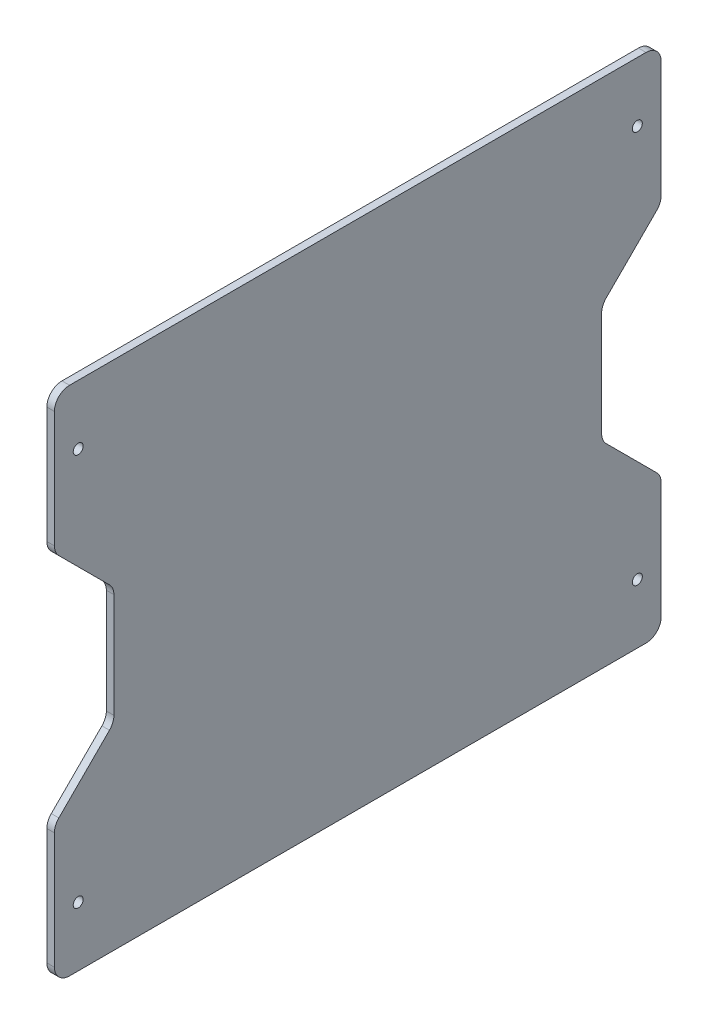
ISO-10303-21;
HEADER;
FILE_DESCRIPTION(('STEP AP214'),'2;1');
FILE_NAME('part.step','',(''),(''),'','','');
FILE_SCHEMA(('AUTOMOTIVE_DESIGN { 1 0 10303 214 1 1 1 1 }'));
ENDSEC;
DATA;
#1=APPLICATION_CONTEXT('core data for automotive mechanical design processes');
#2=APPLICATION_PROTOCOL_DEFINITION('international standard','automotive_design',2000,#1);
#3=PRODUCT_CONTEXT('',#1,'mechanical');
#4=PRODUCT('Part','Part','',(#3));
#5=PRODUCT_RELATED_PRODUCT_CATEGORY('part','',(#4));
#6=PRODUCT_DEFINITION_FORMATION('','',#4);
#7=PRODUCT_DEFINITION_CONTEXT('part definition',#1,'design');
#8=PRODUCT_DEFINITION('design','',#6,#7);
#9=PRODUCT_DEFINITION_SHAPE('','',#8);
#10=(LENGTH_UNIT() NAMED_UNIT(*) SI_UNIT(.MILLI.,.METRE.));
#11=(NAMED_UNIT(*) PLANE_ANGLE_UNIT() SI_UNIT($,.RADIAN.));
#12=(NAMED_UNIT(*) SI_UNIT($,.STERADIAN.) SOLID_ANGLE_UNIT());
#13=UNCERTAINTY_MEASURE_WITH_UNIT(LENGTH_MEASURE(1.E-05),#10,'distance_accuracy_value','');
#14=(GEOMETRIC_REPRESENTATION_CONTEXT(3) GLOBAL_UNCERTAINTY_ASSIGNED_CONTEXT((#13)) GLOBAL_UNIT_ASSIGNED_CONTEXT((#10,
#11,#12)) REPRESENTATION_CONTEXT('',''));
#15=CARTESIAN_POINT('',(0.,0.,0.));
#16=DIRECTION('',(0.,0.,1.));
#17=DIRECTION('',(1.,0.,0.));
#18=AXIS2_PLACEMENT_3D('',#15,#16,#17);
#19=CARTESIAN_POINT('',(-2194.40014568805,-215.000000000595,-470.023442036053));
#20=DIRECTION('',(-1.,0.,0.));
#21=DIRECTION('',(0.,0.,1.));
#22=AXIS2_PLACEMENT_3D('',#19,#20,#21);
#23=PLANE('',#22);
#24=CARTESIAN_POINT('',(-2194.40014568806,-190.000000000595,-10.0000000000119));
#25=DIRECTION('',(1.,0.,0.));
#26=DIRECTION('',(0.,0.,-1.));
#27=AXIS2_PLACEMENT_3D('',#24,#25,#26);
#28=CIRCLE('',#27,2.09500000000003);
#29=CARTESIAN_POINT('',(-2194.40014568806,-190.000000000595,-12.0950000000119));
#30=VERTEX_POINT('',#29);
#31=EDGE_CURVE('E406',#30,#30,#28,.T.);
#32=ORIENTED_EDGE('',*,*,#31,.T.);
#33=EDGE_LOOP('',(#32));
#34=FACE_BOUND('',#33,.T.);
#35=DIRECTION('',(0.,-0.707106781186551,-0.707106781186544));
#36=VECTOR('',#35,1.);
#37=CARTESIAN_POINT('',(-2194.40014568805,-132.100000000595,-230.000000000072));
#38=LINE('',#37,#36);
#39=CARTESIAN_POINT('',(-2194.40014568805,-133.959871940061,-231.859871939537));
#40=VERTEX_POINT('',#39);
#41=CARTESIAN_POINT('',(-2194.40014568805,-155.240128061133,-253.140128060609));
#42=VERTEX_POINT('',#41);
#43=EDGE_CURVE('E272',#40,#42,#38,.T.);
#44=ORIENTED_EDGE('',*,*,#43,.T.);
#45=CARTESIAN_POINT('',(-2194.40014568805,-159.730256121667,-248.650000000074));
#46=DIRECTION('',(-1.,0.,0.));
#47=DIRECTION('',(0.,0.,1.));
#48=AXIS2_PLACEMENT_3D('',#45,#46,#47);
#49=CIRCLE('',#48,6.35);
#50=CARTESIAN_POINT('',(-2194.40014568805,-159.730256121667,-255.000000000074));
#51=VERTEX_POINT('',#50);
#52=EDGE_CURVE('E326',#42,#51,#49,.T.);
#53=ORIENTED_EDGE('',*,*,#52,.T.);
#54=DIRECTION('',(0.,-1.,0.));
#55=VECTOR('',#54,1.);
#56=CARTESIAN_POINT('',(-2194.40014568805,-215.000000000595,-255.000000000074));
#57=LINE('',#56,#55);
#58=CARTESIAN_POINT('',(-2194.40014568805,-208.650000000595,-255.000000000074));
#59=VERTEX_POINT('',#58);
#60=EDGE_CURVE('E259',#51,#59,#57,.T.);
#61=ORIENTED_EDGE('',*,*,#60,.T.);
#62=CARTESIAN_POINT('',(-2194.40014568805,-208.650000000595,-248.650000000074));
#63=DIRECTION('',(-1.,0.,0.));
#64=DIRECTION('',(0.,0.,1.));
#65=AXIS2_PLACEMENT_3D('',#62,#63,#64);
#66=CIRCLE('',#65,6.35);
#67=CARTESIAN_POINT('',(-2194.40014568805,-215.000000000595,-248.650000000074));
#68=VERTEX_POINT('',#67);
#69=EDGE_CURVE('E63',#59,#68,#66,.T.);
#70=ORIENTED_EDGE('',*,*,#69,.T.);
#71=DIRECTION('',(0.,0.,1.));
#72=VECTOR('',#71,1.);
#73=CARTESIAN_POINT('',(-2194.40014568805,-215.000000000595,-470.023442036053));
#74=LINE('',#73,#72);
#75=CARTESIAN_POINT('',(-2194.40014568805,-215.000000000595,-6.35000000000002));
#76=VERTEX_POINT('',#75);
#77=EDGE_CURVE('E258',#68,#76,#74,.T.);
#78=ORIENTED_EDGE('',*,*,#77,.T.);
#79=CARTESIAN_POINT('',(-2194.40014568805,-208.650000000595,-6.35));
#80=DIRECTION('',(-1.,0.,0.));
#81=DIRECTION('',(0.,0.,1.));
#82=AXIS2_PLACEMENT_3D('',#79,#80,#81);
#83=CIRCLE('',#82,6.35);
#84=CARTESIAN_POINT('',(-2194.40014568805,-208.650000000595,0.));
#85=VERTEX_POINT('',#84);
#86=EDGE_CURVE('E313',#76,#85,#83,.T.);
#87=ORIENTED_EDGE('',*,*,#86,.T.);
#88=DIRECTION('',(0.,-1.,0.));
#89=VECTOR('',#88,1.);
#90=CARTESIAN_POINT('',(-2194.40014568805,-215.000000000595,0.));
#91=LINE('',#90,#89);
#92=CARTESIAN_POINT('',(-2194.40014568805,-159.730256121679,0.));
#93=VERTEX_POINT('',#92);
#94=EDGE_CURVE('E246',#93,#85,#91,.T.);
#95=ORIENTED_EDGE('',*,*,#94,.F.);
#96=CARTESIAN_POINT('',(-2194.40014568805,-159.730256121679,-6.35));
#97=DIRECTION('',(-1.,0.,0.));
#98=DIRECTION('',(0.,0.,1.));
#99=AXIS2_PLACEMENT_3D('',#96,#97,#98);
#100=CIRCLE('',#99,6.35);
#101=CARTESIAN_POINT('',(-2194.40014568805,-155.240128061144,-1.85987193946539));
#102=VERTEX_POINT('',#101);
#103=EDGE_CURVE('E322',#93,#102,#100,.T.);
#104=ORIENTED_EDGE('',*,*,#103,.T.);
#105=DIRECTION('',(0.,0.707106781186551,-0.707106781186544));
#106=VECTOR('',#105,1.);
#107=CARTESIAN_POINT('',(-2194.40014568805,-157.500000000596,0.399999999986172));
#108=LINE('',#107,#106);
#109=CARTESIAN_POINT('',(-2194.40014568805,-133.959871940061,-23.1401280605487));
#110=VERTEX_POINT('',#109);
#111=EDGE_CURVE('E283',#102,#110,#108,.T.);
#112=ORIENTED_EDGE('',*,*,#111,.T.);
#113=CARTESIAN_POINT('',(-2194.40014568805,-129.469743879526,-18.650000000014));
#114=DIRECTION('',(-1.,0.,0.));
#115=DIRECTION('',(0.,0.,1.));
#116=AXIS2_PLACEMENT_3D('',#113,#114,#115);
#117=CIRCLE('',#116,6.35);
#118=CARTESIAN_POINT('',(-2194.40014568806,-129.469743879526,-25.000000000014));
#119=VERTEX_POINT('',#118);
#120=EDGE_CURVE('E377',#110,#119,#117,.F.);
#121=ORIENTED_EDGE('',*,*,#120,.T.);
#122=DIRECTION('',(0.,1.,0.));
#123=VECTOR('',#122,1.);
#124=CARTESIAN_POINT('',(-2194.40014568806,0.,-25.000000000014));
#125=LINE('',#124,#123);
#126=CARTESIAN_POINT('',(-2194.40014568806,-85.5302561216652,-25.000000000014));
#127=VERTEX_POINT('',#126);
#128=EDGE_CURVE('E382',#119,#127,#125,.T.);
#129=ORIENTED_EDGE('',*,*,#128,.T.);
#130=CARTESIAN_POINT('',(-2194.40014568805,-85.5302561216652,-18.650000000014));
#131=DIRECTION('',(-1.,0.,0.));
#132=DIRECTION('',(0.,0.,1.));
#133=AXIS2_PLACEMENT_3D('',#130,#131,#132);
#134=CIRCLE('',#133,6.35);
#135=CARTESIAN_POINT('',(-2194.40014568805,-81.0401280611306,-23.1401280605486));
#136=VERTEX_POINT('',#135);
#137=EDGE_CURVE('E49',#127,#136,#134,.F.);
#138=ORIENTED_EDGE('',*,*,#137,.T.);
#139=DIRECTION('',(0.,-0.707106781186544,-0.707106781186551));
#140=VECTOR('',#139,1.);
#141=CARTESIAN_POINT('',(-2194.40014568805,-82.900000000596,-25.000000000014));
#142=LINE('',#141,#140);
#143=CARTESIAN_POINT('',(-2194.40014568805,-59.7598719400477,-1.85987193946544));
#144=VERTEX_POINT('',#143);
#145=EDGE_CURVE('E277',#136,#144,#142,.F.);
#146=ORIENTED_EDGE('',*,*,#145,.T.);
#147=CARTESIAN_POINT('',(-2194.40014568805,-55.2697438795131,-6.35));
#148=DIRECTION('',(-1.,0.,0.));
#149=DIRECTION('',(0.,0.,1.));
#150=AXIS2_PLACEMENT_3D('',#147,#148,#149);
#151=CIRCLE('',#150,6.35);
#152=CARTESIAN_POINT('',(-2194.40014568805,-55.2697438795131,0.));
#153=VERTEX_POINT('',#152);
#154=EDGE_CURVE('E320',#144,#153,#151,.T.);
#155=ORIENTED_EDGE('',*,*,#154,.T.);
#156=CARTESIAN_POINT('',(-2194.40014568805,-6.35000000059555,0.));
#157=VERTEX_POINT('',#156);
#158=EDGE_CURVE('E242',#157,#153,#91,.T.);
#159=ORIENTED_EDGE('',*,*,#158,.F.);
#160=CARTESIAN_POINT('',(-2194.40014568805,-6.35000000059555,-6.35));
#161=DIRECTION('',(-1.,0.,0.));
#162=DIRECTION('',(0.,0.,1.));
#163=AXIS2_PLACEMENT_3D('',#160,#161,#162);
#164=CIRCLE('',#163,6.35);
#165=CARTESIAN_POINT('',(-2194.40014568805,-5.9555138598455E-10,-6.35000000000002));
#166=VERTEX_POINT('',#165);
#167=EDGE_CURVE('E318',#157,#166,#164,.T.);
#168=ORIENTED_EDGE('',*,*,#167,.T.);
#169=DIRECTION('',(0.,0.,1.));
#170=VECTOR('',#169,1.);
#171=CARTESIAN_POINT('',(-2194.40014568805,-5.9555138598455E-10,-470.023442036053));
#172=LINE('',#171,#170);
#173=CARTESIAN_POINT('',(-2194.40014568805,-5.9555138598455E-10,-248.650000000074));
#174=VERTEX_POINT('',#173);
#175=EDGE_CURVE('E245',#174,#166,#172,.T.);
#176=ORIENTED_EDGE('',*,*,#175,.F.);
#177=CARTESIAN_POINT('',(-2194.40014568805,-6.35000000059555,-248.650000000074));
#178=DIRECTION('',(-1.,0.,0.));
#179=DIRECTION('',(0.,0.,1.));
#180=AXIS2_PLACEMENT_3D('',#177,#178,#179);
#181=CIRCLE('',#180,6.35);
#182=CARTESIAN_POINT('',(-2194.40014568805,-6.35000000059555,-255.000000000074));
#183=VERTEX_POINT('',#182);
#184=EDGE_CURVE('E316',#174,#183,#181,.T.);
#185=ORIENTED_EDGE('',*,*,#184,.T.);
#186=CARTESIAN_POINT('',(-2194.40014568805,-55.2697438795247,-255.000000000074));
#187=VERTEX_POINT('',#186);
#188=EDGE_CURVE('E255',#183,#187,#57,.T.);
#189=ORIENTED_EDGE('',*,*,#188,.T.);
#190=CARTESIAN_POINT('',(-2194.40014568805,-55.2697438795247,-248.650000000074));
#191=DIRECTION('',(-1.,0.,0.));
#192=DIRECTION('',(0.,0.,1.));
#193=AXIS2_PLACEMENT_3D('',#190,#191,#192);
#194=CIRCLE('',#193,6.35);
#195=CARTESIAN_POINT('',(-2194.40014568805,-59.7598719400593,-253.140128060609));
#196=VERTEX_POINT('',#195);
#197=EDGE_CURVE('E324',#187,#196,#194,.T.);
#198=ORIENTED_EDGE('',*,*,#197,.T.);
#199=DIRECTION('',(0.,0.707106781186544,-0.707106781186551));
#200=VECTOR('',#199,1.);
#201=CARTESIAN_POINT('',(-2194.40014568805,-57.5000000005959,-255.400000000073));
#202=LINE('',#201,#200);
#203=CARTESIAN_POINT('',(-2194.40014568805,-81.0401280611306,-231.859871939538));
#204=VERTEX_POINT('',#203);
#205=EDGE_CURVE('E267',#196,#204,#202,.F.);
#206=ORIENTED_EDGE('',*,*,#205,.T.);
#207=CARTESIAN_POINT('',(-2194.40014568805,-85.5302561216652,-236.350000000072));
#208=DIRECTION('',(-1.,0.,0.));
#209=DIRECTION('',(0.,0.,1.));
#210=AXIS2_PLACEMENT_3D('',#207,#208,#209);
#211=CIRCLE('',#210,6.35);
#212=CARTESIAN_POINT('',(-2194.40014568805,-85.5302561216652,-230.000000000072));
#213=VERTEX_POINT('',#212);
#214=EDGE_CURVE('E230',#204,#213,#211,.F.);
#215=ORIENTED_EDGE('',*,*,#214,.T.);
#216=DIRECTION('',(0.,1.,0.));
#217=VECTOR('',#216,1.);
#218=CARTESIAN_POINT('',(-2194.40014568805,0.,-230.000000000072));
#219=LINE('',#218,#217);
#220=CARTESIAN_POINT('',(-2194.40014568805,-129.469743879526,-230.000000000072));
#221=VERTEX_POINT('',#220);
#222=EDGE_CURVE('E220',#221,#213,#219,.T.);
#223=ORIENTED_EDGE('',*,*,#222,.F.);
#224=CARTESIAN_POINT('',(-2194.40014568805,-129.469743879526,-236.350000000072));
#225=DIRECTION('',(-1.,0.,0.));
#226=DIRECTION('',(0.,0.,1.));
#227=AXIS2_PLACEMENT_3D('',#224,#225,#226);
#228=CIRCLE('',#227,6.35);
#229=EDGE_CURVE('E203',#221,#40,#228,.F.);
#230=ORIENTED_EDGE('',*,*,#229,.T.);
#231=EDGE_LOOP('',(#44,#53,#61,#70,#78,#87,#95,#104,#112,#121,#129,#138,#146,#155,#159,#168,
#176,#185,#189,#198,#206,#215,#223,#230));
#232=FACE_BOUND('',#231,.T.);
#233=CARTESIAN_POINT('',(-2194.40014568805,-25.0000000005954,-245.000000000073));
#234=DIRECTION('',(-1.,0.,0.));
#235=DIRECTION('',(0.,0.,1.));
#236=AXIS2_PLACEMENT_3D('',#233,#234,#235);
#237=CIRCLE('',#236,2.095);
#238=CARTESIAN_POINT('',(-2194.40014568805,-25.0000000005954,-242.905000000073));
#239=VERTEX_POINT('',#238);
#240=EDGE_CURVE('E239',#239,#239,#237,.T.);
#241=ORIENTED_EDGE('',*,*,#240,.F.);
#242=EDGE_LOOP('',(#241));
#243=FACE_BOUND('',#242,.T.);
#244=CARTESIAN_POINT('',(-2194.40014568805,-190.000000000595,-245.000000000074));
#245=DIRECTION('',(-1.,0.,0.));
#246=DIRECTION('',(0.,0.,1.));
#247=AXIS2_PLACEMENT_3D('',#244,#245,#246);
#248=CIRCLE('',#247,2.09500000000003);
#249=CARTESIAN_POINT('',(-2194.40014568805,-190.000000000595,-242.905000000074));
#250=VERTEX_POINT('',#249);
#251=EDGE_CURVE('E236',#250,#250,#248,.T.);
#252=ORIENTED_EDGE('',*,*,#251,.F.);
#253=EDGE_LOOP('',(#252));
#254=FACE_BOUND('',#253,.T.);
#255=CARTESIAN_POINT('',(-2194.40014568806,-25.0000000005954,-10.0000000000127));
#256=DIRECTION('',(1.,0.,0.));
#257=DIRECTION('',(0.,0.,-1.));
#258=AXIS2_PLACEMENT_3D('',#255,#256,#257);
#259=CIRCLE('',#258,2.095);
#260=CARTESIAN_POINT('',(-2194.40014568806,-25.0000000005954,-12.0950000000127));
#261=VERTEX_POINT('',#260);
#262=EDGE_CURVE('E428',#261,#261,#259,.T.);
#263=ORIENTED_EDGE('',*,*,#262,.T.);
#264=EDGE_LOOP('',(#263));
#265=FACE_BOUND('',#264,.T.);
#266=ADVANCED_FACE('F41',(#34,#232,#243,#254,#265),#23,.T.);
#267=CARTESIAN_POINT('',(-2191.22514568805,-215.000000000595,-470.023442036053));
#268=DIRECTION('',(1.,0.,0.));
#269=DIRECTION('',(0.,0.,-1.));
#270=AXIS2_PLACEMENT_3D('',#267,#268,#269);
#271=PLANE('',#270);
#272=CARTESIAN_POINT('',(-2191.22514568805,-190.000000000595,-10.0000000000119));
#273=DIRECTION('',(1.,0.,0.));
#274=DIRECTION('',(0.,0.,-1.));
#275=AXIS2_PLACEMENT_3D('',#272,#273,#274);
#276=CIRCLE('',#275,2.09500000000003);
#277=CARTESIAN_POINT('',(-2191.22514568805,-190.000000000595,-12.0950000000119));
#278=VERTEX_POINT('',#277);
#279=EDGE_CURVE('E402',#278,#278,#276,.T.);
#280=ORIENTED_EDGE('',*,*,#279,.F.);
#281=EDGE_LOOP('',(#280));
#282=FACE_BOUND('',#281,.T.);
#283=DIRECTION('',(0.,1.,0.));
#284=VECTOR('',#283,1.);
#285=CARTESIAN_POINT('',(-2191.22514568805,-215.000000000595,-255.000000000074));
#286=LINE('',#285,#284);
#287=CARTESIAN_POINT('',(-2191.22514568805,-208.650000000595,-255.000000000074));
#288=VERTEX_POINT('',#287);
#289=CARTESIAN_POINT('',(-2191.22514568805,-159.730256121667,-255.000000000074));
#290=VERTEX_POINT('',#289);
#291=EDGE_CURVE('E253',#288,#290,#286,.T.);
#292=ORIENTED_EDGE('',*,*,#291,.T.);
#293=CARTESIAN_POINT('',(-2191.22514568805,-159.730256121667,-248.650000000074));
#294=DIRECTION('',(1.,0.,0.));
#295=DIRECTION('',(0.,0.,-1.));
#296=AXIS2_PLACEMENT_3D('',#293,#294,#295);
#297=CIRCLE('',#296,6.35);
#298=CARTESIAN_POINT('',(-2191.22514568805,-155.240128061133,-253.140128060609));
#299=VERTEX_POINT('',#298);
#300=EDGE_CURVE('E311',#290,#299,#297,.T.);
#301=ORIENTED_EDGE('',*,*,#300,.T.);
#302=DIRECTION('',(0.,0.707106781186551,0.707106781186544));
#303=VECTOR('',#302,1.);
#304=CARTESIAN_POINT('',(-2191.22514568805,-132.100000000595,-230.000000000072));
#305=LINE('',#304,#303);
#306=CARTESIAN_POINT('',(-2191.22514568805,-133.959871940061,-231.859871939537));
#307=VERTEX_POINT('',#306);
#308=EDGE_CURVE('E274',#299,#307,#305,.T.);
#309=ORIENTED_EDGE('',*,*,#308,.T.);
#310=CARTESIAN_POINT('',(-2191.22514568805,-129.469743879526,-236.350000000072));
#311=DIRECTION('',(1.,0.,0.));
#312=DIRECTION('',(0.,0.,-1.));
#313=AXIS2_PLACEMENT_3D('',#310,#311,#312);
#314=CIRCLE('',#313,6.35);
#315=CARTESIAN_POINT('',(-2191.22514568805,-129.469743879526,-230.000000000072));
#316=VERTEX_POINT('',#315);
#317=EDGE_CURVE('E212',#307,#316,#314,.F.);
#318=ORIENTED_EDGE('',*,*,#317,.T.);
#319=DIRECTION('',(0.,1.,0.));
#320=VECTOR('',#319,1.);
#321=CARTESIAN_POINT('',(-2191.22514568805,0.,-230.000000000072));
#322=LINE('',#321,#320);
#323=CARTESIAN_POINT('',(-2191.22514568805,-85.5302561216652,-230.000000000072));
#324=VERTEX_POINT('',#323);
#325=EDGE_CURVE('E223',#316,#324,#322,.T.);
#326=ORIENTED_EDGE('',*,*,#325,.T.);
#327=CARTESIAN_POINT('',(-2191.22514568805,-85.5302561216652,-236.350000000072));
#328=DIRECTION('',(1.,0.,0.));
#329=DIRECTION('',(0.,0.,-1.));
#330=AXIS2_PLACEMENT_3D('',#327,#328,#329);
#331=CIRCLE('',#330,6.35);
#332=CARTESIAN_POINT('',(-2191.22514568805,-81.0401280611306,-231.859871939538));
#333=VERTEX_POINT('',#332);
#334=EDGE_CURVE('E372',#324,#333,#331,.F.);
#335=ORIENTED_EDGE('',*,*,#334,.T.);
#336=DIRECTION('',(0.,-0.707106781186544,0.707106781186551));
#337=VECTOR('',#336,1.);
#338=CARTESIAN_POINT('',(-2191.22514568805,-57.5000000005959,-255.400000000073));
#339=LINE('',#338,#337);
#340=CARTESIAN_POINT('',(-2191.22514568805,-59.7598719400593,-253.140128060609));
#341=VERTEX_POINT('',#340);
#342=EDGE_CURVE('E269',#333,#341,#339,.F.);
#343=ORIENTED_EDGE('',*,*,#342,.T.);
#344=CARTESIAN_POINT('',(-2191.22514568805,-55.2697438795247,-248.650000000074));
#345=DIRECTION('',(1.,0.,0.));
#346=DIRECTION('',(0.,0.,-1.));
#347=AXIS2_PLACEMENT_3D('',#344,#345,#346);
#348=CIRCLE('',#347,6.35);
#349=CARTESIAN_POINT('',(-2191.22514568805,-55.2697438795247,-255.000000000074));
#350=VERTEX_POINT('',#349);
#351=EDGE_CURVE('E309',#341,#350,#348,.T.);
#352=ORIENTED_EDGE('',*,*,#351,.T.);
#353=CARTESIAN_POINT('',(-2191.22514568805,-6.35000000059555,-255.000000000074));
#354=VERTEX_POINT('',#353);
#355=EDGE_CURVE('E250',#350,#354,#286,.T.);
#356=ORIENTED_EDGE('',*,*,#355,.T.);
#357=CARTESIAN_POINT('',(-2191.22514568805,-6.35000000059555,-248.650000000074));
#358=DIRECTION('',(1.,0.,0.));
#359=DIRECTION('',(0.,0.,-1.));
#360=AXIS2_PLACEMENT_3D('',#357,#358,#359);
#361=CIRCLE('',#360,6.35);
#362=CARTESIAN_POINT('',(-2191.22514568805,-5.9555138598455E-10,-248.650000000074));
#363=VERTEX_POINT('',#362);
#364=EDGE_CURVE('E301',#354,#363,#361,.T.);
#365=ORIENTED_EDGE('',*,*,#364,.T.);
#366=DIRECTION('',(0.,0.,1.));
#367=VECTOR('',#366,1.);
#368=CARTESIAN_POINT('',(-2191.22514568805,-5.9555138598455E-10,-470.023442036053));
#369=LINE('',#368,#367);
#370=CARTESIAN_POINT('',(-2191.22514568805,-5.9555138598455E-10,-6.35000000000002));
#371=VERTEX_POINT('',#370);
#372=EDGE_CURVE('E264',#363,#371,#369,.T.);
#373=ORIENTED_EDGE('',*,*,#372,.T.);
#374=CARTESIAN_POINT('',(-2191.22514568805,-6.35000000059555,-6.35));
#375=DIRECTION('',(1.,0.,0.));
#376=DIRECTION('',(0.,0.,-1.));
#377=AXIS2_PLACEMENT_3D('',#374,#375,#376);
#378=CIRCLE('',#377,6.35);
#379=CARTESIAN_POINT('',(-2191.22514568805,-6.35000000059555,0.));
#380=VERTEX_POINT('',#379);
#381=EDGE_CURVE('E303',#371,#380,#378,.T.);
#382=ORIENTED_EDGE('',*,*,#381,.T.);
#383=DIRECTION('',(0.,1.,0.));
#384=VECTOR('',#383,1.);
#385=CARTESIAN_POINT('',(-2191.22514568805,-215.000000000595,0.));
#386=LINE('',#385,#384);
#387=CARTESIAN_POINT('',(-2191.22514568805,-55.2697438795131,0.));
#388=VERTEX_POINT('',#387);
#389=EDGE_CURVE('E233',#388,#380,#386,.T.);
#390=ORIENTED_EDGE('',*,*,#389,.F.);
#391=CARTESIAN_POINT('',(-2191.22514568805,-55.2697438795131,-6.35));
#392=DIRECTION('',(1.,0.,0.));
#393=DIRECTION('',(0.,0.,-1.));
#394=AXIS2_PLACEMENT_3D('',#391,#392,#393);
#395=CIRCLE('',#394,6.35);
#396=CARTESIAN_POINT('',(-2191.22514568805,-59.7598719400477,-1.85987193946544));
#397=VERTEX_POINT('',#396);
#398=EDGE_CURVE('E305',#388,#397,#395,.T.);
#399=ORIENTED_EDGE('',*,*,#398,.T.);
#400=DIRECTION('',(0.,0.707106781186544,0.707106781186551));
#401=VECTOR('',#400,1.);
#402=CARTESIAN_POINT('',(-2191.22514568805,-82.9000000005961,-25.000000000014));
#403=LINE('',#402,#401);
#404=CARTESIAN_POINT('',(-2191.22514568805,-81.0401280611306,-23.1401280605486));
#405=VERTEX_POINT('',#404);
#406=EDGE_CURVE('E280',#397,#405,#403,.F.);
#407=ORIENTED_EDGE('',*,*,#406,.T.);
#408=CARTESIAN_POINT('',(-2191.22514568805,-85.5302561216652,-18.650000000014));
#409=DIRECTION('',(1.,0.,0.));
#410=DIRECTION('',(0.,0.,-1.));
#411=AXIS2_PLACEMENT_3D('',#408,#409,#410);
#412=CIRCLE('',#411,6.35);
#413=CARTESIAN_POINT('',(-2191.22514568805,-85.5302561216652,-25.000000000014));
#414=VERTEX_POINT('',#413);
#415=EDGE_CURVE('E11',#405,#414,#412,.F.);
#416=ORIENTED_EDGE('',*,*,#415,.T.);
#417=DIRECTION('',(0.,1.,0.));
#418=VECTOR('',#417,1.);
#419=CARTESIAN_POINT('',(-2191.22514568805,0.,-25.000000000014));
#420=LINE('',#419,#418);
#421=CARTESIAN_POINT('',(-2191.22514568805,-129.469743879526,-25.000000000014));
#422=VERTEX_POINT('',#421);
#423=EDGE_CURVE('E398',#422,#414,#420,.T.);
#424=ORIENTED_EDGE('',*,*,#423,.F.);
#425=CARTESIAN_POINT('',(-2191.22514568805,-129.469743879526,-18.650000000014));
#426=DIRECTION('',(1.,0.,0.));
#427=DIRECTION('',(0.,0.,-1.));
#428=AXIS2_PLACEMENT_3D('',#425,#426,#427);
#429=CIRCLE('',#428,6.35);
#430=CARTESIAN_POINT('',(-2191.22514568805,-133.959871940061,-23.1401280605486));
#431=VERTEX_POINT('',#430);
#432=EDGE_CURVE('E375',#422,#431,#429,.F.);
#433=ORIENTED_EDGE('',*,*,#432,.T.);
#434=DIRECTION('',(0.,-0.707106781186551,0.707106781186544));
#435=VECTOR('',#434,1.);
#436=CARTESIAN_POINT('',(-2191.22514568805,-157.500000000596,0.399999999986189));
#437=LINE('',#436,#435);
#438=CARTESIAN_POINT('',(-2191.22514568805,-155.240128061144,-1.85987193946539));
#439=VERTEX_POINT('',#438);
#440=EDGE_CURVE('E286',#431,#439,#437,.T.);
#441=ORIENTED_EDGE('',*,*,#440,.T.);
#442=CARTESIAN_POINT('',(-2191.22514568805,-159.730256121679,-6.35));
#443=DIRECTION('',(1.,0.,0.));
#444=DIRECTION('',(0.,0.,-1.));
#445=AXIS2_PLACEMENT_3D('',#442,#443,#444);
#446=CIRCLE('',#445,6.35);
#447=CARTESIAN_POINT('',(-2191.22514568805,-159.730256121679,0.));
#448=VERTEX_POINT('',#447);
#449=EDGE_CURVE('E307',#439,#448,#446,.T.);
#450=ORIENTED_EDGE('',*,*,#449,.T.);
#451=CARTESIAN_POINT('',(-2191.22514568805,-208.650000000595,0.));
#452=VERTEX_POINT('',#451);
#453=EDGE_CURVE('E249',#452,#448,#386,.T.);
#454=ORIENTED_EDGE('',*,*,#453,.F.);
#455=CARTESIAN_POINT('',(-2191.22514568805,-208.650000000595,-6.35));
#456=DIRECTION('',(1.,0.,0.));
#457=DIRECTION('',(0.,0.,-1.));
#458=AXIS2_PLACEMENT_3D('',#455,#456,#457);
#459=CIRCLE('',#458,6.35);
#460=CARTESIAN_POINT('',(-2191.22514568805,-215.000000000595,-6.35000000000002));
#461=VERTEX_POINT('',#460);
#462=EDGE_CURVE('E297',#452,#461,#459,.T.);
#463=ORIENTED_EDGE('',*,*,#462,.T.);
#464=DIRECTION('',(0.,0.,1.));
#465=VECTOR('',#464,1.);
#466=CARTESIAN_POINT('',(-2191.22514568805,-215.000000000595,-470.023442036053));
#467=LINE('',#466,#465);
#468=CARTESIAN_POINT('',(-2191.22514568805,-215.000000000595,-248.650000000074));
#469=VERTEX_POINT('',#468);
#470=EDGE_CURVE('E254',#469,#461,#467,.T.);
#471=ORIENTED_EDGE('',*,*,#470,.F.);
#472=CARTESIAN_POINT('',(-2191.22514568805,-208.650000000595,-248.650000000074));
#473=DIRECTION('',(1.,0.,0.));
#474=DIRECTION('',(0.,0.,-1.));
#475=AXIS2_PLACEMENT_3D('',#472,#473,#474);
#476=CIRCLE('',#475,6.35);
#477=EDGE_CURVE('E299',#469,#288,#476,.T.);
#478=ORIENTED_EDGE('',*,*,#477,.T.);
#479=EDGE_LOOP('',(#292,#301,#309,#318,#326,#335,#343,#352,#356,#365,#373,#382,#390,#399,#407,
#416,#424,#433,#441,#450,#454,#463,#471,#478));
#480=FACE_BOUND('',#479,.T.);
#481=CARTESIAN_POINT('',(-2191.22514568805,-25.0000000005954,-245.000000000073));
#482=DIRECTION('',(1.,0.,0.));
#483=DIRECTION('',(0.,0.,-1.));
#484=AXIS2_PLACEMENT_3D('',#481,#482,#483);
#485=CIRCLE('',#484,2.095);
#486=CARTESIAN_POINT('',(-2191.22514568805,-25.0000000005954,-247.095000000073));
#487=VERTEX_POINT('',#486);
#488=EDGE_CURVE('E413',#487,#487,#485,.F.);
#489=ORIENTED_EDGE('',*,*,#488,.T.);
#490=EDGE_LOOP('',(#489));
#491=FACE_BOUND('',#490,.T.);
#492=CARTESIAN_POINT('',(-2191.22514568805,-190.000000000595,-245.000000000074));
#493=DIRECTION('',(1.,0.,0.));
#494=DIRECTION('',(0.,0.,-1.));
#495=AXIS2_PLACEMENT_3D('',#492,#493,#494);
#496=CIRCLE('',#495,2.09500000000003);
#497=CARTESIAN_POINT('',(-2191.22514568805,-190.000000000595,-247.095000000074));
#498=VERTEX_POINT('',#497);
#499=EDGE_CURVE('E231',#498,#498,#496,.F.);
#500=ORIENTED_EDGE('',*,*,#499,.T.);
#501=EDGE_LOOP('',(#500));
#502=FACE_BOUND('',#501,.T.);
#503=CARTESIAN_POINT('',(-2191.22514568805,-25.0000000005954,-10.0000000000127));
#504=DIRECTION('',(1.,0.,0.));
#505=DIRECTION('',(0.,0.,-1.));
#506=AXIS2_PLACEMENT_3D('',#503,#504,#505);
#507=CIRCLE('',#506,2.095);
#508=CARTESIAN_POINT('',(-2191.22514568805,-25.0000000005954,-12.0950000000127));
#509=VERTEX_POINT('',#508);
#510=EDGE_CURVE('E409',#509,#509,#507,.T.);
#511=ORIENTED_EDGE('',*,*,#510,.F.);
#512=EDGE_LOOP('',(#511));
#513=FACE_BOUND('',#512,.T.);
#514=ADVANCED_FACE('F396',(#282,#480,#491,#502,#513),#271,.T.);
#515=CARTESIAN_POINT('',(0.,0.,0.));
#516=DIRECTION('',(0.,0.,1.));
#517=DIRECTION('',(1.,0.,0.));
#518=AXIS2_PLACEMENT_3D('',#515,#516,#517);
#519=PLANE('',#518);
#520=ORIENTED_EDGE('',*,*,#158,.T.);
#521=DIRECTION('',(-1.,0.,0.));
#522=VECTOR('',#521,1.);
#523=CARTESIAN_POINT('',(-2191.22514568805,-55.2697438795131,0.));
#524=LINE('',#523,#522);
#525=EDGE_CURVE('E360',#153,#388,#524,.F.);
#526=ORIENTED_EDGE('',*,*,#525,.T.);
#527=ORIENTED_EDGE('',*,*,#389,.T.);
#528=DIRECTION('',(-1.,0.,0.));
#529=VECTOR('',#528,1.);
#530=CARTESIAN_POINT('',(0.,-6.35000000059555,0.));
#531=LINE('',#530,#529);
#532=EDGE_CURVE('E357',#380,#157,#531,.T.);
#533=ORIENTED_EDGE('',*,*,#532,.T.);
#534=EDGE_LOOP('',(#520,#526,#527,#533));
#535=FACE_BOUND('',#534,.T.);
#536=ADVANCED_FACE('F466',(#535),#519,.T.);
#537=CARTESIAN_POINT('',(-2168.52514568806,-5.95468119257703E-10,-255.000000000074));
#538=DIRECTION('',(0.,0.,-1.));
#539=DIRECTION('',(-1.,0.,0.));
#540=AXIS2_PLACEMENT_3D('',#537,#538,#539);
#541=PLANE('',#540);
#542=ORIENTED_EDGE('',*,*,#60,.F.);
#543=DIRECTION('',(1.,0.,0.));
#544=VECTOR('',#543,1.);
#545=CARTESIAN_POINT('',(-2191.22514568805,-159.730256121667,-255.000000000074));
#546=LINE('',#545,#544);
#547=EDGE_CURVE('E294',#51,#290,#546,.T.);
#548=ORIENTED_EDGE('',*,*,#547,.T.);
#549=ORIENTED_EDGE('',*,*,#291,.F.);
#550=DIRECTION('',(1.,0.,0.));
#551=VECTOR('',#550,1.);
#552=CARTESIAN_POINT('',(-2168.52514568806,-208.650000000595,-255.000000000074));
#553=LINE('',#552,#551);
#554=EDGE_CURVE('E292',#288,#59,#553,.F.);
#555=ORIENTED_EDGE('',*,*,#554,.T.);
#556=EDGE_LOOP('',(#542,#548,#549,#555));
#557=FACE_BOUND('',#556,.T.);
#558=ADVANCED_FACE('F477',(#557),#541,.T.);
#559=ORIENTED_EDGE('',*,*,#355,.F.);
#560=DIRECTION('',(1.,0.,0.));
#561=VECTOR('',#560,1.);
#562=CARTESIAN_POINT('',(-2194.40014568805,-55.2697438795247,-255.000000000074));
#563=LINE('',#562,#561);
#564=EDGE_CURVE('E334',#350,#187,#563,.F.);
#565=ORIENTED_EDGE('',*,*,#564,.T.);
#566=ORIENTED_EDGE('',*,*,#188,.F.);
#567=DIRECTION('',(-1.,0.,0.));
#568=VECTOR('',#567,1.);
#569=CARTESIAN_POINT('',(-2168.52514568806,-6.35000000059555,-255.000000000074));
#570=LINE('',#569,#568);
#571=EDGE_CURVE('E332',#183,#354,#570,.F.);
#572=ORIENTED_EDGE('',*,*,#571,.T.);
#573=EDGE_LOOP('',(#559,#565,#566,#572));
#574=FACE_BOUND('',#573,.T.);
#575=ADVANCED_FACE('F464',(#574),#541,.T.);
#576=ORIENTED_EDGE('',*,*,#453,.T.);
#577=DIRECTION('',(-1.,0.,0.));
#578=VECTOR('',#577,1.);
#579=CARTESIAN_POINT('',(-2194.40014568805,-159.730256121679,0.));
#580=LINE('',#579,#578);
#581=EDGE_CURVE('E340',#448,#93,#580,.T.);
#582=ORIENTED_EDGE('',*,*,#581,.T.);
#583=ORIENTED_EDGE('',*,*,#94,.T.);
#584=DIRECTION('',(1.,0.,0.));
#585=VECTOR('',#584,1.);
#586=CARTESIAN_POINT('',(0.,-208.650000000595,0.));
#587=LINE('',#586,#585);
#588=EDGE_CURVE('E337',#85,#452,#587,.T.);
#589=ORIENTED_EDGE('',*,*,#588,.T.);
#590=EDGE_LOOP('',(#576,#582,#583,#589));
#591=FACE_BOUND('',#590,.T.);
#592=ADVANCED_FACE('F460',(#591),#519,.T.);
#593=CARTESIAN_POINT('',(-2191.22514568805,-5.9555138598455E-10,-470.023442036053));
#594=DIRECTION('',(0.,1.,0.));
#595=DIRECTION('',(0.,0.,1.));
#596=AXIS2_PLACEMENT_3D('',#593,#594,#595);
#597=PLANE('',#596);
#598=ORIENTED_EDGE('',*,*,#175,.T.);
#599=DIRECTION('',(-1.,0.,0.));
#600=VECTOR('',#599,1.);
#601=CARTESIAN_POINT('',(-2191.22514568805,-5.9555138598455E-10,-6.35000000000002));
#602=LINE('',#601,#600);
#603=EDGE_CURVE('E366',#166,#371,#602,.F.);
#604=ORIENTED_EDGE('',*,*,#603,.T.);
#605=ORIENTED_EDGE('',*,*,#372,.F.);
#606=DIRECTION('',(-1.,0.,0.));
#607=VECTOR('',#606,1.);
#608=CARTESIAN_POINT('',(-2191.22514568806,-5.9555138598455E-10,-248.650000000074));
#609=LINE('',#608,#607);
#610=EDGE_CURVE('E363',#363,#174,#609,.T.);
#611=ORIENTED_EDGE('',*,*,#610,.T.);
#612=EDGE_LOOP('',(#598,#604,#605,#611));
#613=FACE_BOUND('',#612,.T.);
#614=ADVANCED_FACE('F463',(#613),#597,.T.);
#615=CARTESIAN_POINT('',(-2191.22514568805,-215.000000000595,-470.023442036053));
#616=DIRECTION('',(0.,-1.,0.));
#617=DIRECTION('',(0.,0.,-1.));
#618=AXIS2_PLACEMENT_3D('',#615,#616,#617);
#619=PLANE('',#618);
#620=ORIENTED_EDGE('',*,*,#77,.F.);
#621=DIRECTION('',(1.,0.,0.));
#622=VECTOR('',#621,1.);
#623=CARTESIAN_POINT('',(-2191.22514568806,-215.000000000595,-248.650000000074));
#624=LINE('',#623,#622);
#625=EDGE_CURVE('E213',#68,#469,#624,.T.);
#626=ORIENTED_EDGE('',*,*,#625,.T.);
#627=ORIENTED_EDGE('',*,*,#470,.T.);
#628=DIRECTION('',(1.,0.,0.));
#629=VECTOR('',#628,1.);
#630=CARTESIAN_POINT('',(-2191.22514568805,-215.000000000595,-6.35000000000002));
#631=LINE('',#630,#629);
#632=EDGE_CURVE('E56',#461,#76,#631,.F.);
#633=ORIENTED_EDGE('',*,*,#632,.T.);
#634=EDGE_LOOP('',(#620,#626,#627,#633));
#635=FACE_BOUND('',#634,.T.);
#636=ADVANCED_FACE('F459',(#635),#619,.T.);
#637=CARTESIAN_POINT('',(-2191.22414568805,0.,-230.000000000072));
#638=DIRECTION('',(0.,0.,1.));
#639=DIRECTION('',(1.,0.,0.));
#640=AXIS2_PLACEMENT_3D('',#637,#638,#639);
#641=PLANE('',#640);
#642=ORIENTED_EDGE('',*,*,#325,.F.);
#643=DIRECTION('',(-1.,0.,0.));
#644=VECTOR('',#643,1.);
#645=CARTESIAN_POINT('',(-2194.40014568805,-129.469743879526,-230.000000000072));
#646=LINE('',#645,#644);
#647=EDGE_CURVE('E207',#316,#221,#646,.T.);
#648=ORIENTED_EDGE('',*,*,#647,.T.);
#649=ORIENTED_EDGE('',*,*,#222,.T.);
#650=DIRECTION('',(-1.,0.,0.));
#651=VECTOR('',#650,1.);
#652=CARTESIAN_POINT('',(-2191.22514568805,-85.5302561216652,-230.000000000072));
#653=LINE('',#652,#651);
#654=EDGE_CURVE('E225',#213,#324,#653,.F.);
#655=ORIENTED_EDGE('',*,*,#654,.T.);
#656=EDGE_LOOP('',(#642,#648,#649,#655));
#657=FACE_BOUND('',#656,.T.);
#658=ADVANCED_FACE('F218',(#657),#641,.F.);
#659=CARTESIAN_POINT('',(-2191.22414568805,-190.000000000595,-245.000000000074));
#660=DIRECTION('',(-1.,0.,0.));
#661=DIRECTION('',(0.,0.,1.));
#662=AXIS2_PLACEMENT_3D('',#659,#660,#661);
#663=CYLINDRICAL_SURFACE('',#662,2.09500000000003);
#664=ORIENTED_EDGE('',*,*,#499,.F.);
#665=EDGE_LOOP('',(#664));
#666=FACE_BOUND('',#665,.T.);
#667=ORIENTED_EDGE('',*,*,#251,.T.);
#668=EDGE_LOOP('',(#667));
#669=FACE_BOUND('',#668,.T.);
#670=ADVANCED_FACE('F450',(#666,#669),#663,.F.);
#671=CARTESIAN_POINT('',(-2191.22414568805,-25.0000000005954,-245.000000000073));
#672=DIRECTION('',(-1.,0.,0.));
#673=DIRECTION('',(0.,0.,1.));
#674=AXIS2_PLACEMENT_3D('',#671,#672,#673);
#675=CYLINDRICAL_SURFACE('',#674,2.095);
#676=ORIENTED_EDGE('',*,*,#488,.F.);
#677=EDGE_LOOP('',(#676));
#678=FACE_BOUND('',#677,.T.);
#679=ORIENTED_EDGE('',*,*,#240,.T.);
#680=EDGE_LOOP('',(#679));
#681=FACE_BOUND('',#680,.T.);
#682=ADVANCED_FACE('F419',(#678,#681),#675,.F.);
#683=CARTESIAN_POINT('',(-2191.22414568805,-57.5000000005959,-255.400000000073));
#684=DIRECTION('',(0.,-0.707106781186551,-0.707106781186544));
#685=DIRECTION('',(1.,0.,0.));
#686=AXIS2_PLACEMENT_3D('',#683,#684,#685);
#687=PLANE('',#686);
#688=ORIENTED_EDGE('',*,*,#342,.F.);
#689=DIRECTION('',(1.,0.,0.));
#690=VECTOR('',#689,1.);
#691=CARTESIAN_POINT('',(-2194.40014568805,-81.0401280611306,-231.859871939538));
#692=LINE('',#691,#690);
#693=EDGE_CURVE('E330',#333,#204,#692,.F.);
#694=ORIENTED_EDGE('',*,*,#693,.T.);
#695=ORIENTED_EDGE('',*,*,#205,.F.);
#696=DIRECTION('',(-1.,0.,0.));
#697=VECTOR('',#696,1.);
#698=CARTESIAN_POINT('',(-2191.22514568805,-59.7598719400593,-253.140128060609));
#699=LINE('',#698,#697);
#700=EDGE_CURVE('E328',#196,#341,#699,.F.);
#701=ORIENTED_EDGE('',*,*,#700,.T.);
#702=EDGE_LOOP('',(#688,#694,#695,#701));
#703=FACE_BOUND('',#702,.T.);
#704=ADVANCED_FACE('F455',(#703),#687,.T.);
#705=CARTESIAN_POINT('',(-2191.22414568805,-132.100000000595,-230.000000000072));
#706=DIRECTION('',(0.,-0.707106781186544,0.707106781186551));
#707=DIRECTION('',(-1.,0.,0.));
#708=AXIS2_PLACEMENT_3D('',#705,#706,#707);
#709=PLANE('',#708);
#710=ORIENTED_EDGE('',*,*,#43,.F.);
#711=DIRECTION('',(-1.,0.,0.));
#712=VECTOR('',#711,1.);
#713=CARTESIAN_POINT('',(-2191.22514568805,-133.959871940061,-231.859871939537));
#714=LINE('',#713,#712);
#715=EDGE_CURVE('E208',#40,#307,#714,.F.);
#716=ORIENTED_EDGE('',*,*,#715,.T.);
#717=ORIENTED_EDGE('',*,*,#308,.F.);
#718=DIRECTION('',(1.,0.,0.));
#719=VECTOR('',#718,1.);
#720=CARTESIAN_POINT('',(-2194.40014568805,-155.240128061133,-253.140128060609));
#721=LINE('',#720,#719);
#722=EDGE_CURVE('E224',#299,#42,#721,.F.);
#723=ORIENTED_EDGE('',*,*,#722,.T.);
#724=EDGE_LOOP('',(#710,#716,#717,#723));
#725=FACE_BOUND('',#724,.T.);
#726=ADVANCED_FACE('F447',(#725),#709,.F.);
#727=CARTESIAN_POINT('',(-2191.22414568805,0.,-25.000000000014));
#728=DIRECTION('',(0.,0.,1.));
#729=DIRECTION('',(1.,0.,0.));
#730=AXIS2_PLACEMENT_3D('',#727,#728,#729);
#731=PLANE('',#730);
#732=ORIENTED_EDGE('',*,*,#128,.F.);
#733=DIRECTION('',(1.,0.,0.));
#734=VECTOR('',#733,1.);
#735=CARTESIAN_POINT('',(-2191.22414568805,-129.469743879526,-25.000000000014));
#736=LINE('',#735,#734);
#737=EDGE_CURVE('E350',#119,#422,#736,.T.);
#738=ORIENTED_EDGE('',*,*,#737,.T.);
#739=ORIENTED_EDGE('',*,*,#423,.T.);
#740=DIRECTION('',(1.,0.,0.));
#741=VECTOR('',#740,1.);
#742=CARTESIAN_POINT('',(-2191.22414568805,-85.5302561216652,-25.000000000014));
#743=LINE('',#742,#741);
#744=EDGE_CURVE('E347',#414,#127,#743,.F.);
#745=ORIENTED_EDGE('',*,*,#744,.T.);
#746=EDGE_LOOP('',(#732,#738,#739,#745));
#747=FACE_BOUND('',#746,.T.);
#748=ADVANCED_FACE('F400',(#747),#731,.T.);
#749=CARTESIAN_POINT('',(-2191.22414568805,-190.000000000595,-10.0000000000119));
#750=DIRECTION('',(-1.,0.,0.));
#751=DIRECTION('',(0.,0.,1.));
#752=AXIS2_PLACEMENT_3D('',#749,#750,#751);
#753=CYLINDRICAL_SURFACE('',#752,2.09500000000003);
#754=ORIENTED_EDGE('',*,*,#279,.T.);
#755=EDGE_LOOP('',(#754));
#756=FACE_BOUND('',#755,.T.);
#757=ORIENTED_EDGE('',*,*,#31,.F.);
#758=EDGE_LOOP('',(#757));
#759=FACE_BOUND('',#758,.T.);
#760=ADVANCED_FACE('F435',(#756,#759),#753,.F.);
#761=CARTESIAN_POINT('',(-2191.22414568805,-25.0000000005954,-10.0000000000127));
#762=DIRECTION('',(-1.,0.,0.));
#763=DIRECTION('',(0.,0.,1.));
#764=AXIS2_PLACEMENT_3D('',#761,#762,#763);
#765=CYLINDRICAL_SURFACE('',#764,2.095);
#766=ORIENTED_EDGE('',*,*,#510,.T.);
#767=EDGE_LOOP('',(#766));
#768=FACE_BOUND('',#767,.T.);
#769=ORIENTED_EDGE('',*,*,#262,.F.);
#770=EDGE_LOOP('',(#769));
#771=FACE_BOUND('',#770,.T.);
#772=ADVANCED_FACE('F437',(#768,#771),#765,.F.);
#773=CARTESIAN_POINT('',(-2191.22414568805,-82.9000000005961,-25.000000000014));
#774=DIRECTION('',(0.,-0.707106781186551,0.707106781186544));
#775=DIRECTION('',(1.,0.,0.));
#776=AXIS2_PLACEMENT_3D('',#773,#774,#775);
#777=PLANE('',#776);
#778=ORIENTED_EDGE('',*,*,#145,.F.);
#779=DIRECTION('',(-1.,0.,0.));
#780=VECTOR('',#779,1.);
#781=CARTESIAN_POINT('',(-2191.22414568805,-81.0401280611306,-23.1401280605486));
#782=LINE('',#781,#780);
#783=EDGE_CURVE('E355',#136,#405,#782,.F.);
#784=ORIENTED_EDGE('',*,*,#783,.T.);
#785=ORIENTED_EDGE('',*,*,#406,.F.);
#786=DIRECTION('',(1.,0.,0.));
#787=VECTOR('',#786,1.);
#788=CARTESIAN_POINT('',(-2194.40014568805,-59.7598719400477,-1.85987193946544));
#789=LINE('',#788,#787);
#790=EDGE_CURVE('E353',#397,#144,#789,.F.);
#791=ORIENTED_EDGE('',*,*,#790,.T.);
#792=EDGE_LOOP('',(#778,#784,#785,#791));
#793=FACE_BOUND('',#792,.T.);
#794=ADVANCED_FACE('F387',(#793),#777,.T.);
#795=CARTESIAN_POINT('',(-2191.22414568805,-157.500000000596,0.399999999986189));
#796=DIRECTION('',(0.,-0.707106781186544,-0.707106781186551));
#797=DIRECTION('',(-1.,0.,0.));
#798=AXIS2_PLACEMENT_3D('',#795,#796,#797);
#799=PLANE('',#798);
#800=ORIENTED_EDGE('',*,*,#111,.F.);
#801=DIRECTION('',(-1.,0.,0.));
#802=VECTOR('',#801,1.);
#803=CARTESIAN_POINT('',(-2191.22514568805,-155.240128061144,-1.85987193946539));
#804=LINE('',#803,#802);
#805=EDGE_CURVE('E345',#102,#439,#804,.F.);
#806=ORIENTED_EDGE('',*,*,#805,.T.);
#807=ORIENTED_EDGE('',*,*,#440,.F.);
#808=DIRECTION('',(1.,0.,0.));
#809=VECTOR('',#808,1.);
#810=CARTESIAN_POINT('',(-2191.22414568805,-133.959871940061,-23.1401280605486));
#811=LINE('',#810,#809);
#812=EDGE_CURVE('E343',#431,#110,#811,.F.);
#813=ORIENTED_EDGE('',*,*,#812,.T.);
#814=EDGE_LOOP('',(#800,#806,#807,#813));
#815=FACE_BOUND('',#814,.T.);
#816=ADVANCED_FACE('F497',(#815),#799,.F.);
#817=CARTESIAN_POINT('',(-2191.22414568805,-129.469743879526,-236.350000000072));
#818=DIRECTION('',(1.,0.,0.));
#819=DIRECTION('',(0.,0.,-1.));
#820=AXIS2_PLACEMENT_3D('',#817,#818,#819);
#821=CYLINDRICAL_SURFACE('',#820,6.35);
#822=ORIENTED_EDGE('',*,*,#317,.F.);
#823=ORIENTED_EDGE('',*,*,#715,.F.);
#824=ORIENTED_EDGE('',*,*,#229,.F.);
#825=ORIENTED_EDGE('',*,*,#647,.F.);
#826=EDGE_LOOP('',(#822,#823,#824,#825));
#827=FACE_BOUND('',#826,.T.);
#828=ADVANCED_FACE('F206',(#827),#821,.F.);
#829=CARTESIAN_POINT('',(-2168.52514568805,-159.730256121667,-248.650000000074));
#830=DIRECTION('',(-1.,0.,0.));
#831=DIRECTION('',(0.,-1.,0.));
#832=AXIS2_PLACEMENT_3D('',#829,#830,#831);
#833=CYLINDRICAL_SURFACE('',#832,6.35);
#834=ORIENTED_EDGE('',*,*,#52,.F.);
#835=ORIENTED_EDGE('',*,*,#722,.F.);
#836=ORIENTED_EDGE('',*,*,#300,.F.);
#837=ORIENTED_EDGE('',*,*,#547,.F.);
#838=EDGE_LOOP('',(#834,#835,#836,#837));
#839=FACE_BOUND('',#838,.T.);
#840=ADVANCED_FACE('F505',(#839),#833,.T.);
#841=CARTESIAN_POINT('',(-2191.22414568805,-85.5302561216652,-236.350000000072));
#842=DIRECTION('',(1.,0.,0.));
#843=DIRECTION('',(0.,0.,-1.));
#844=AXIS2_PLACEMENT_3D('',#841,#842,#843);
#845=CYLINDRICAL_SURFACE('',#844,6.35);
#846=ORIENTED_EDGE('',*,*,#214,.F.);
#847=ORIENTED_EDGE('',*,*,#693,.F.);
#848=ORIENTED_EDGE('',*,*,#334,.F.);
#849=ORIENTED_EDGE('',*,*,#654,.F.);
#850=EDGE_LOOP('',(#846,#847,#848,#849));
#851=FACE_BOUND('',#850,.T.);
#852=ADVANCED_FACE('F508',(#851),#845,.F.);
#853=CARTESIAN_POINT('',(-2168.52514568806,-55.269743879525,-248.650000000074));
#854=DIRECTION('',(-1.,0.,0.));
#855=DIRECTION('',(0.,0.,1.));
#856=AXIS2_PLACEMENT_3D('',#853,#854,#855);
#857=CYLINDRICAL_SURFACE('',#856,6.35);
#858=ORIENTED_EDGE('',*,*,#351,.F.);
#859=ORIENTED_EDGE('',*,*,#700,.F.);
#860=ORIENTED_EDGE('',*,*,#197,.F.);
#861=ORIENTED_EDGE('',*,*,#564,.F.);
#862=EDGE_LOOP('',(#858,#859,#860,#861));
#863=FACE_BOUND('',#862,.T.);
#864=ADVANCED_FACE('F512',(#863),#857,.T.);
#865=CARTESIAN_POINT('',(1.71068234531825E-12,-159.730256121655,-6.35));
#866=DIRECTION('',(1.,0.,0.));
#867=DIRECTION('',(0.,1.,0.));
#868=AXIS2_PLACEMENT_3D('',#865,#866,#867);
#869=CYLINDRICAL_SURFACE('',#868,6.35);
#870=ORIENTED_EDGE('',*,*,#449,.F.);
#871=ORIENTED_EDGE('',*,*,#805,.F.);
#872=ORIENTED_EDGE('',*,*,#103,.F.);
#873=ORIENTED_EDGE('',*,*,#581,.F.);
#874=EDGE_LOOP('',(#870,#871,#872,#873));
#875=FACE_BOUND('',#874,.T.);
#876=ADVANCED_FACE('F516',(#875),#869,.T.);
#877=CARTESIAN_POINT('',(-2191.22414568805,-129.469743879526,-18.650000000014));
#878=DIRECTION('',(1.,0.,0.));
#879=DIRECTION('',(0.,0.,-1.));
#880=AXIS2_PLACEMENT_3D('',#877,#878,#879);
#881=CYLINDRICAL_SURFACE('',#880,6.35);
#882=ORIENTED_EDGE('',*,*,#120,.F.);
#883=ORIENTED_EDGE('',*,*,#812,.F.);
#884=ORIENTED_EDGE('',*,*,#432,.F.);
#885=ORIENTED_EDGE('',*,*,#737,.F.);
#886=EDGE_LOOP('',(#882,#883,#884,#885));
#887=FACE_BOUND('',#886,.T.);
#888=ADVANCED_FACE('F520',(#887),#881,.F.);
#889=CARTESIAN_POINT('',(-2191.22414568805,-85.5302561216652,-18.650000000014));
#890=DIRECTION('',(1.,0.,0.));
#891=DIRECTION('',(0.,0.,-1.));
#892=AXIS2_PLACEMENT_3D('',#889,#890,#891);
#893=CYLINDRICAL_SURFACE('',#892,6.35);
#894=ORIENTED_EDGE('',*,*,#415,.F.);
#895=ORIENTED_EDGE('',*,*,#783,.F.);
#896=ORIENTED_EDGE('',*,*,#137,.F.);
#897=ORIENTED_EDGE('',*,*,#744,.F.);
#898=EDGE_LOOP('',(#894,#895,#896,#897));
#899=FACE_BOUND('',#898,.T.);
#900=ADVANCED_FACE('F391',(#899),#893,.F.);
#901=CARTESIAN_POINT('',(-5.91929026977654E-13,-55.2697438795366,-6.35));
#902=DIRECTION('',(1.,0.,0.));
#903=DIRECTION('',(0.,1.,0.));
#904=AXIS2_PLACEMENT_3D('',#901,#902,#903);
#905=CYLINDRICAL_SURFACE('',#904,6.35);
#906=ORIENTED_EDGE('',*,*,#154,.F.);
#907=ORIENTED_EDGE('',*,*,#790,.F.);
#908=ORIENTED_EDGE('',*,*,#398,.F.);
#909=ORIENTED_EDGE('',*,*,#525,.F.);
#910=EDGE_LOOP('',(#906,#907,#908,#909));
#911=FACE_BOUND('',#910,.T.);
#912=ADVANCED_FACE('F527',(#911),#905,.T.);
#913=CARTESIAN_POINT('',(0.,-6.35000000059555,-6.35));
#914=DIRECTION('',(-1.,0.,0.));
#915=DIRECTION('',(0.,0.,1.));
#916=AXIS2_PLACEMENT_3D('',#913,#914,#915);
#917=CYLINDRICAL_SURFACE('',#916,6.35);
#918=ORIENTED_EDGE('',*,*,#381,.F.);
#919=ORIENTED_EDGE('',*,*,#603,.F.);
#920=ORIENTED_EDGE('',*,*,#167,.F.);
#921=ORIENTED_EDGE('',*,*,#532,.F.);
#922=EDGE_LOOP('',(#918,#919,#920,#921));
#923=FACE_BOUND('',#922,.T.);
#924=ADVANCED_FACE('F530',(#923),#917,.T.);
#925=CARTESIAN_POINT('',(-2191.22514568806,-6.35000000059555,-248.650000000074));
#926=DIRECTION('',(-1.,0.,0.));
#927=DIRECTION('',(0.,0.,1.));
#928=AXIS2_PLACEMENT_3D('',#925,#926,#927);
#929=CYLINDRICAL_SURFACE('',#928,6.35);
#930=ORIENTED_EDGE('',*,*,#364,.F.);
#931=ORIENTED_EDGE('',*,*,#571,.F.);
#932=ORIENTED_EDGE('',*,*,#184,.F.);
#933=ORIENTED_EDGE('',*,*,#610,.F.);
#934=EDGE_LOOP('',(#930,#931,#932,#933));
#935=FACE_BOUND('',#934,.T.);
#936=ADVANCED_FACE('F534',(#935),#929,.T.);
#937=CARTESIAN_POINT('',(-2191.22514568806,-208.650000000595,-248.650000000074));
#938=DIRECTION('',(1.,0.,0.));
#939=DIRECTION('',(0.,0.,-1.));
#940=AXIS2_PLACEMENT_3D('',#937,#938,#939);
#941=CYLINDRICAL_SURFACE('',#940,6.35);
#942=ORIENTED_EDGE('',*,*,#69,.F.);
#943=ORIENTED_EDGE('',*,*,#554,.F.);
#944=ORIENTED_EDGE('',*,*,#477,.F.);
#945=ORIENTED_EDGE('',*,*,#625,.F.);
#946=EDGE_LOOP('',(#942,#943,#944,#945));
#947=FACE_BOUND('',#946,.T.);
#948=ADVANCED_FACE('F537',(#947),#941,.T.);
#949=CARTESIAN_POINT('',(0.,-208.650000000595,-6.35));
#950=DIRECTION('',(1.,0.,0.));
#951=DIRECTION('',(0.,0.,-1.));
#952=AXIS2_PLACEMENT_3D('',#949,#950,#951);
#953=CYLINDRICAL_SURFACE('',#952,6.35);
#954=ORIENTED_EDGE('',*,*,#86,.F.);
#955=ORIENTED_EDGE('',*,*,#632,.F.);
#956=ORIENTED_EDGE('',*,*,#462,.F.);
#957=ORIENTED_EDGE('',*,*,#588,.F.);
#958=EDGE_LOOP('',(#954,#955,#956,#957));
#959=FACE_BOUND('',#958,.T.);
#960=ADVANCED_FACE('F43',(#959),#953,.T.);
#961=CLOSED_SHELL('',(#266,#514,#536,#558,#575,#592,#614,#636,#658,#670,#682,#704,#726,#748,
#760,#772,#794,#816,#828,#840,#852,#864,#876,#888,#900,#912,#924,#936,#948,#960));
#962=MANIFOLD_SOLID_BREP('B2',#961);
#963=ADVANCED_BREP_SHAPE_REPRESENTATION('',(#18,#962),#14);
#964=SHAPE_DEFINITION_REPRESENTATION(#9,#963);
ENDSEC;
END-ISO-10303-21;
